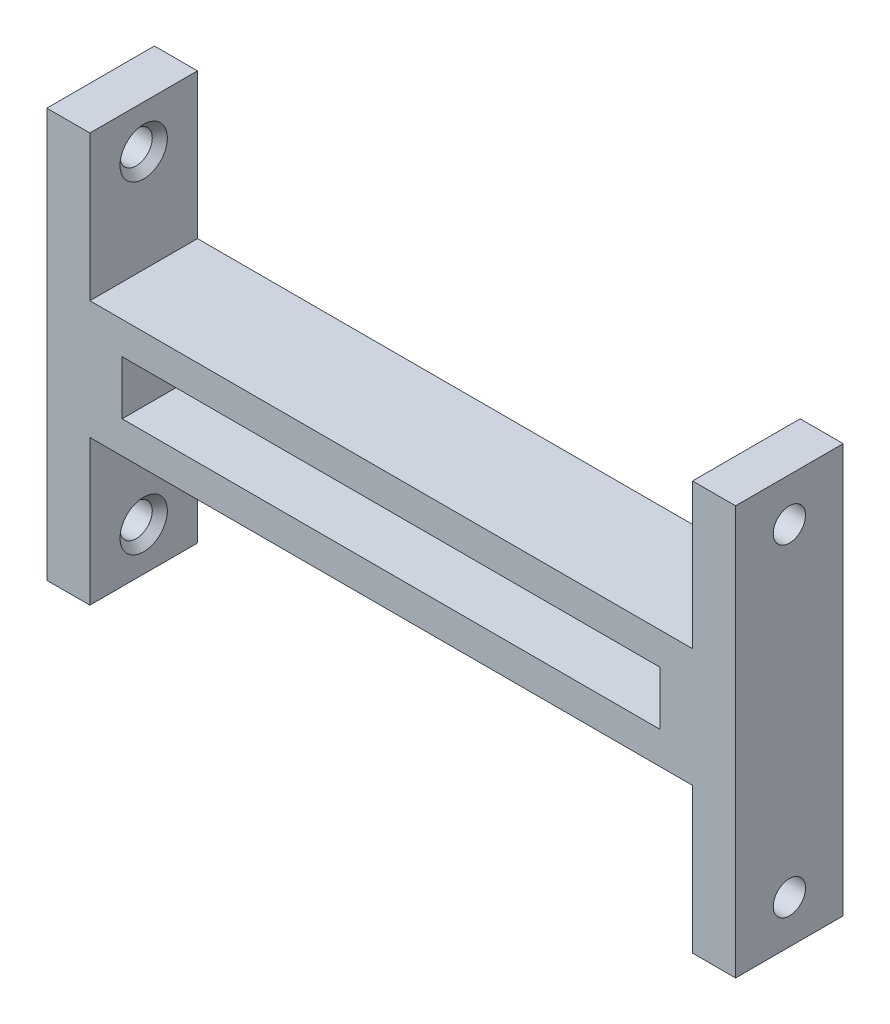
from build123d import *

# Parameters (mm, degrees)
SKETCH1_W                                           = 50
SKETCH1_H                                           = 5
BOSS_EXTRUDE1_DEPTH                                 = 10
SKETCH4_R                                           = 0.5
CUT_EXTRUDE1_DEPTH                                  = 85.201997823
SKETCH11_R                                          = 1.5
CUT_EXTRUDE2_DEPTH                                  = 85.201997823
CSK_FOR_M2_COUNTERSUNK_FLAT_HEAD_SCREW1_D           = 2.4
CSK_FOR_M2_COUNTERSUNK_FLAT_HEAD_SCREW1_DEPTH       = 4
CSK_FOR_M2_COUNTERSUNK_FLAT_HEAD_SCREW1_CSINK_D     = 4.4
CSK_FOR_M2_COUNTERSUNK_FLAT_HEAD_SCREW1_CSINK_ANGLE = 90


with BuildPart() as part:
    # Sketch1 → Boss-Extrude1 (new body)
    with BuildSketch(Plane.XY):
        Polygon((-4.830205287, 40.295691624), (51.169794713, 40.295691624), (51.169794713, 53.795691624), (55.169794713, 53.795691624), (55.169794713, 15.795691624), (51.169794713, 15.795691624), (51.169794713, 29.295691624), (-4.830205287, 29.295691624), (-4.830205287, 15.795691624), (-8.830205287, 15.795691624), (-8.830205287, 53.795691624), (-4.830205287, 53.795691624), align=None)
        with Locations((23.169794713, 34.795691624)):
            Rectangle(SKETCH1_W, SKETCH1_H, mode=Mode.SUBTRACT)
    extrude(amount=BOSS_EXTRUDE1_DEPTH)

    # Sketch4 → Cut-Extrude1 (cut, through all)
    with BuildSketch(Plane.ZY.offset(8.830205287)):
        with Locations((5, 49.795691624)):
            Circle(SKETCH4_R)
        with Locations(Location((5, 19.795691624, 0), (0, 0, 90))):
            Circle(SKETCH4_R)
    extrude(amount=-CUT_EXTRUDE1_DEPTH, mode=Mode.SUBTRACT)

    # Sketch11 → Cut-Extrude2 (cut, through all)
    with BuildSketch(Plane.ZY.offset(8.830205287)):
        with Locations((5, 49.795691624)):
            Circle(SKETCH11_R)
        with Locations((5, 19.795691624)):
            Circle(SKETCH11_R)
    extrude(amount=-CUT_EXTRUDE2_DEPTH, mode=Mode.SUBTRACT)

    # CSK for M2 Countersunk Flat Head Screw1
    with Locations(Plane.ZY.offset(-51.169794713)):
        with Locations((5, 49.795691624), (5, 19.795691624)):
            csk_for_m2_countersunk_flat_head_screw1 = CounterSinkHole(CSK_FOR_M2_COUNTERSUNK_FLAT_HEAD_SCREW1_D / 2, CSK_FOR_M2_COUNTERSUNK_FLAT_HEAD_SCREW1_CSINK_D / 2, depth=CSK_FOR_M2_COUNTERSUNK_FLAT_HEAD_SCREW1_DEPTH, counter_sink_angle=CSK_FOR_M2_COUNTERSUNK_FLAT_HEAD_SCREW1_CSINK_ANGLE)

    # Mirror2: CSK for M2 Countersunk Flat Head Screw1 across plane
    add(csk_for_m2_countersunk_flat_head_screw1.mirror(Plane(origin=(23.169794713, 0, 0), x_dir=(0, 0, 1), z_dir=(1, 0, 0))), mode=Mode.SUBTRACT)


solid = part.part
